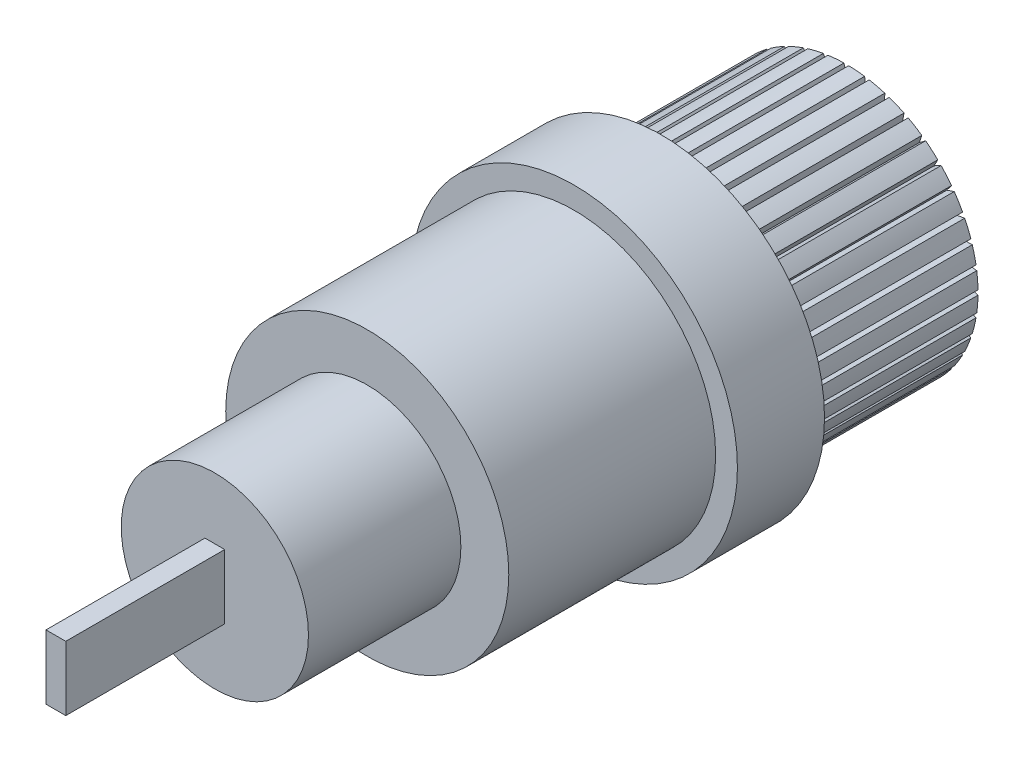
from build123d import *

# Parameters (mm, degrees)
SKETCH_1_R               = 6.05
EXTRUDE_1_DEPTH          = 8.5
SKETCH_2_R               = 7.5
EXTRUDE_2_DEPTH          = 4
SKETCH_3_R               = 6.5
EXTRUDE_3_DEPTH          = 9.5
SKETCH_4_R               = 4.3
EXTRUDE_4_DEPTH          = 7
SKETCH_5_W               = 0.908028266
SKETCH_5_H               = 2.95691256
EXTRUDE_5_DEPTH          = 7.3
CUT_EXTRUDE_2_DEPTH      = 8.5
PATTERN_CIRCULAR_1_COUNT = 40


with BuildPart() as part:
    # Sketch 1 → Extrude 1 (new body)
    with BuildSketch(Plane.XY):
        Circle(SKETCH_1_R)
    extrude(amount=EXTRUDE_1_DEPTH)

    # Sketch 2 → Extrude 2 (add)
    with BuildSketch(Plane.XY.offset(8.5)):
        Circle(SKETCH_2_R)
    extrude(amount=EXTRUDE_2_DEPTH)

    # Sketch 3 → Extrude 3 (add)
    with BuildSketch(Plane.XY.offset(12.5)):
        Circle(SKETCH_3_R)
    extrude(amount=EXTRUDE_3_DEPTH)

    # Sketch 4 → Extrude 4 (add)
    with BuildSketch(Plane.XY.offset(22)):
        Circle(SKETCH_4_R)
    extrude(amount=EXTRUDE_4_DEPTH)

    # Sketch 5 → Extrude 5 (add)
    with BuildSketch(Plane.XY.offset(29)):
        Rectangle(SKETCH_5_W, SKETCH_5_H)
    extrude(amount=EXTRUDE_5_DEPTH)

    # Sketch 6 → Cut-Extrude 2 (cut)
    with BuildSketch(Plane(origin=(0, 0, 0), x_dir=(-1, 0, 0), z_dir=(0, 0, -1))):
        Polygon((-0.314317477, 6.724442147), (0, 5.7), (0.314317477, 6.724442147), align=None)
    cut_extrude_2 = extrude(amount=-CUT_EXTRUDE_2_DEPTH, mode=Mode.SUBTRACT)

    # Pattern Circular 1: Cut-Extrude 2 ×40 about axis
    pattern_circular_1_axis = Axis((0, -0.001936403, 0), (0, 0, 1))
    for i in range(1, PATTERN_CIRCULAR_1_COUNT):
        add(cut_extrude_2.rotate(pattern_circular_1_axis, i * 360 / PATTERN_CIRCULAR_1_COUNT), mode=Mode.SUBTRACT)


solid = part.part
